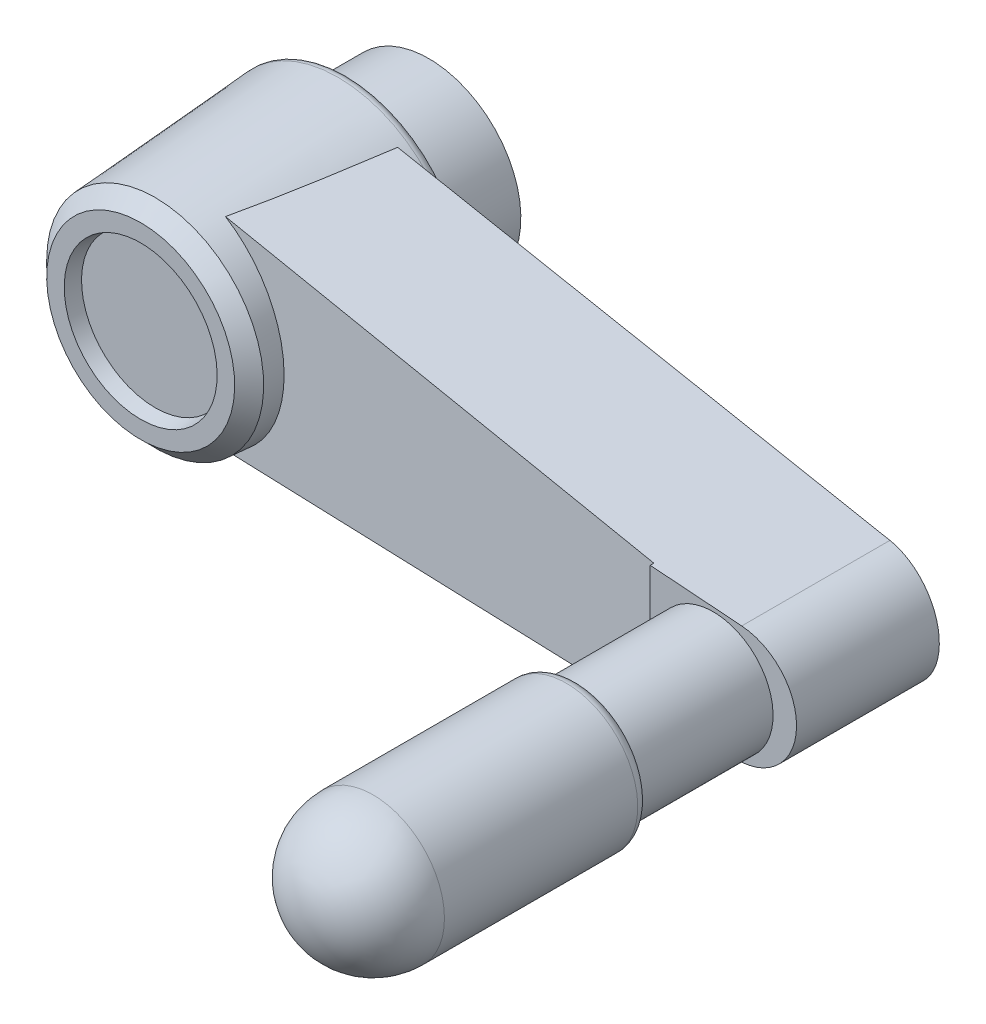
ISO-10303-21;
HEADER;
FILE_DESCRIPTION(('STEP AP214'),'2;1');
FILE_NAME('part.step','',(''),(''),'','','');
FILE_SCHEMA(('AUTOMOTIVE_DESIGN { 1 0 10303 214 1 1 1 1 }'));
ENDSEC;
DATA;
#1=APPLICATION_CONTEXT('core data for automotive mechanical design processes');
#2=APPLICATION_PROTOCOL_DEFINITION('international standard','automotive_design',2000,#1);
#3=PRODUCT_CONTEXT('',#1,'mechanical');
#4=PRODUCT('Part','Part','',(#3));
#5=PRODUCT_RELATED_PRODUCT_CATEGORY('part','',(#4));
#6=PRODUCT_DEFINITION_FORMATION('','',#4);
#7=PRODUCT_DEFINITION_CONTEXT('part definition',#1,'design');
#8=PRODUCT_DEFINITION('design','',#6,#7);
#9=PRODUCT_DEFINITION_SHAPE('','',#8);
#10=(LENGTH_UNIT() NAMED_UNIT(*) SI_UNIT(.MILLI.,.METRE.));
#11=(NAMED_UNIT(*) PLANE_ANGLE_UNIT() SI_UNIT($,.RADIAN.));
#12=(NAMED_UNIT(*) SI_UNIT($,.STERADIAN.) SOLID_ANGLE_UNIT());
#13=UNCERTAINTY_MEASURE_WITH_UNIT(LENGTH_MEASURE(1.E-05),#10,'distance_accuracy_value','');
#14=(GEOMETRIC_REPRESENTATION_CONTEXT(3) GLOBAL_UNCERTAINTY_ASSIGNED_CONTEXT((#13)) GLOBAL_UNIT_ASSIGNED_CONTEXT((#10,
#11,#12)) REPRESENTATION_CONTEXT('',''));
#15=CARTESIAN_POINT('',(0.,0.,0.));
#16=DIRECTION('',(0.,0.,1.));
#17=DIRECTION('',(1.,0.,0.));
#18=AXIS2_PLACEMENT_3D('',#15,#16,#17);
#19=CARTESIAN_POINT('',(56.85,-22.5,33.));
#20=DIRECTION('',(0.,0.,-1.));
#21=DIRECTION('',(0.,1.,0.));
#22=AXIS2_PLACEMENT_3D('',#19,#20,#21);
#23=PLANE('',#22);
#24=CARTESIAN_POINT('',(64.,0.,33.));
#25=DIRECTION('',(0.,0.,1.));
#26=DIRECTION('',(0.,-1.,0.));
#27=AXIS2_PLACEMENT_3D('',#24,#25,#26);
#28=CIRCLE('',#27,4.875);
#29=CARTESIAN_POINT('',(64.,-4.875,33.));
#30=VERTEX_POINT('',#29);
#31=EDGE_CURVE('E369',#30,#30,#28,.T.);
#32=ORIENTED_EDGE('',*,*,#31,.F.);
#33=EDGE_LOOP('',(#32));
#34=FACE_BOUND('',#33,.T.);
#35=CARTESIAN_POINT('',(66.3214285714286,0.,33.));
#36=DIRECTION('',(0.,0.,1.));
#37=DIRECTION('',(0.,-1.,0.));
#38=AXIS2_PLACEMENT_3D('',#35,#36,#37);
#39=CIRCLE('',#38,6.42857142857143);
#40=CARTESIAN_POINT('',(66.7938126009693,6.41119208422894,33.));
#41=VERTEX_POINT('',#40);
#42=CARTESIAN_POINT('',(66.7938126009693,-6.41119208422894,33.));
#43=VERTEX_POINT('',#42);
#44=EDGE_CURVE('E165',#41,#43,#39,.F.);
#45=ORIENTED_EDGE('',*,*,#44,.F.);
#46=DIRECTION('',(-0.997296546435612,0.0734819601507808,0.));
#47=VECTOR('',#46,1.);
#48=CARTESIAN_POINT('',(66.7938126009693,6.41119208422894,33.));
#49=LINE('',#48,#47);
#50=CARTESIAN_POINT('',(56.85,7.14386366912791,33.));
#51=VERTEX_POINT('',#50);
#52=EDGE_CURVE('E163',#51,#41,#49,.F.);
#53=ORIENTED_EDGE('',*,*,#52,.F.);
#54=DIRECTION('',(0.,1.,0.));
#55=VECTOR('',#54,1.);
#56=CARTESIAN_POINT('',(56.85,-22.5,33.));
#57=LINE('',#56,#55);
#58=CARTESIAN_POINT('',(56.85,-7.14386366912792,33.));
#59=VERTEX_POINT('',#58);
#60=EDGE_CURVE('E174',#59,#51,#57,.T.);
#61=ORIENTED_EDGE('',*,*,#60,.F.);
#62=DIRECTION('',(-0.997296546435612,-0.0734819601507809,0.));
#63=VECTOR('',#62,1.);
#64=CARTESIAN_POINT('',(66.7938126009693,-6.41119208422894,33.));
#65=LINE('',#64,#63);
#66=EDGE_CURVE('E171',#43,#59,#65,.T.);
#67=ORIENTED_EDGE('',*,*,#66,.F.);
#68=EDGE_LOOP('',(#45,#53,#61,#67));
#69=FACE_BOUND('',#68,.T.);
#70=ADVANCED_FACE('F15',(#34,#69),#23,.F.);
#71=CARTESIAN_POINT('',(66.3214285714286,0.,54.));
#72=DIRECTION('',(0.,0.,1.));
#73=DIRECTION('',(0.,-1.,0.));
#74=AXIS2_PLACEMENT_3D('',#71,#72,#73);
#75=CYLINDRICAL_SURFACE('',#74,6.42857142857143);
#76=CARTESIAN_POINT('',(66.3214285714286,0.,16.8547342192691));
#77=DIRECTION('',(-0.098357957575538,0.,0.995151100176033));
#78=DIRECTION('',(0.995151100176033,0.,0.098357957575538));
#79=AXIS2_PLACEMENT_3D('',#76,#77,#78);
#80=ELLIPSE('',#79,6.4598948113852,6.42857142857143);
#81=CARTESIAN_POINT('',(66.7938126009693,-6.41119208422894,16.9014233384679));
#82=VERTEX_POINT('',#81);
#83=CARTESIAN_POINT('',(66.7938126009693,6.41119208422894,16.9014233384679));
#84=VERTEX_POINT('',#83);
#85=EDGE_CURVE('E144',#82,#84,#80,.T.);
#86=ORIENTED_EDGE('',*,*,#85,.T.);
#87=DIRECTION('',(0.,0.,1.));
#88=VECTOR('',#87,1.);
#89=CARTESIAN_POINT('',(66.7938126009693,6.41119208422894,54.));
#90=LINE('',#89,#88);
#91=EDGE_CURVE('E159',#41,#84,#90,.F.);
#92=ORIENTED_EDGE('',*,*,#91,.F.);
#93=ORIENTED_EDGE('',*,*,#44,.T.);
#94=DIRECTION('',(0.,0.,1.));
#95=VECTOR('',#94,1.);
#96=CARTESIAN_POINT('',(66.7938126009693,-6.41119208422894,54.));
#97=LINE('',#96,#95);
#98=EDGE_CURVE('E153',#43,#82,#97,.F.);
#99=ORIENTED_EDGE('',*,*,#98,.T.);
#100=EDGE_LOOP('',(#86,#92,#93,#99));
#101=FACE_BOUND('',#100,.T.);
#102=ADVANCED_FACE('F399',(#101),#75,.T.);
#103=CARTESIAN_POINT('',(66.7938126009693,6.41119208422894,54.));
#104=DIRECTION('',(0.0734819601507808,0.997296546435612,0.));
#105=DIRECTION('',(-0.997296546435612,0.0734819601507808,0.));
#106=AXIS2_PLACEMENT_3D('',#103,#104,#105);
#107=PLANE('',#106);
#108=ORIENTED_EDGE('',*,*,#91,.T.);
#109=DIRECTION('',(-0.992486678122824,0.0731275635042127,-0.0980946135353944));
#110=VECTOR('',#109,1.);
#111=CARTESIAN_POINT('',(66.7938126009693,6.41119208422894,16.9014233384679));
#112=LINE('',#111,#110);
#113=CARTESIAN_POINT('',(7.45140024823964,10.7836094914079,11.0361849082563));
#114=VERTEX_POINT('',#113);
#115=EDGE_CURVE('E162',#84,#114,#112,.T.);
#116=ORIENTED_EDGE('',*,*,#115,.T.);
#117=CARTESIAN_POINT('',(7.45140024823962,10.7836094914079,11.0361849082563));
#118=CARTESIAN_POINT('',(7.35884986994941,10.7904287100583,11.7083102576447));
#119=CARTESIAN_POINT('',(7.2649001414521,10.7973510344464,12.380240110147));
#120=CARTESIAN_POINT('',(7.07377479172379,10.8114333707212,13.7236404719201));
#121=CARTESIAN_POINT('',(6.97659915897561,10.8185933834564,14.3951109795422));
#122=CARTESIAN_POINT('',(6.679647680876,10.8404731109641,16.4083572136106));
#123=CARTESIAN_POINT('',(6.47439717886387,10.8555962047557,17.7493347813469));
#124=CARTESIAN_POINT('',(6.15147821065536,10.8793892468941,19.7584309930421));
#125=CARTESIAN_POINT('',(6.04132594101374,10.8875053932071,20.427765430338));
#126=CARTESIAN_POINT('',(5.81495956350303,10.9041843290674,21.7653928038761));
#127=CARTESIAN_POINT('',(5.69874557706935,10.9127471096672,22.4336857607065));
#128=CARTESIAN_POINT('',(5.45886515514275,10.9304217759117,23.7691170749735));
#129=CARTESIAN_POINT('',(5.33519675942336,10.939533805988,24.4362550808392));
#130=CARTESIAN_POINT('',(5.14263983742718,10.9537216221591,25.4356189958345));
#131=CARTESIAN_POINT('',(5.07727608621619,10.9585376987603,25.7685279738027));
#132=CARTESIAN_POINT('',(4.94384165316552,10.9683693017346,26.4338053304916));
#133=CARTESIAN_POINT('',(4.87577092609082,10.9733848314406,26.7661737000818));
#134=CARTESIAN_POINT('',(4.80616947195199,10.9785131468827,27.0982236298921));
#135=B_SPLINE_CURVE_WITH_KNOTS('',3,(#117,#118,#119,#120,#121,#122,#123,#124,#125,#126,#127,
#128,#129,#130,#131,#132,#133,#134),.UNSPECIFIED.,.F.,.F.,(4,2,2,2,2,2,2,2,4),(0.,
2.03549899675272,4.07100526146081,8.14090618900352,10.1760438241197,12.2111407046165,
14.2467750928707,15.2646628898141,16.2825677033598),.UNSPECIFIED.);
#136=CARTESIAN_POINT('',(4.80616947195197,10.9785131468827,27.0982236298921));
#137=VERTEX_POINT('',#136);
#138=EDGE_CURVE('E140',#114,#137,#135,.T.);
#139=ORIENTED_EDGE('',*,*,#138,.T.);
#140=DIRECTION('',(0.991799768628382,-0.0730769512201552,0.104847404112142));
#141=VECTOR('',#140,1.);
#142=CARTESIAN_POINT('',(4.80616947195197,10.9785131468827,27.0982236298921));
#143=LINE('',#142,#141);
#144=CARTESIAN_POINT('',(56.85,7.14386366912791,32.6));
#145=VERTEX_POINT('',#144);
#146=EDGE_CURVE('E168',#137,#145,#143,.T.);
#147=ORIENTED_EDGE('',*,*,#146,.T.);
#148=DIRECTION('',(-1.42108547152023E-13,0.,1.));
#149=VECTOR('',#148,1.);
#150=CARTESIAN_POINT('',(56.85,7.14386366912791,32.6));
#151=LINE('',#150,#149);
#152=EDGE_CURVE('E194',#145,#51,#151,.T.);
#153=ORIENTED_EDGE('',*,*,#152,.T.);
#154=ORIENTED_EDGE('',*,*,#52,.T.);
#155=EDGE_LOOP('',(#108,#116,#139,#147,#153,#154));
#156=FACE_BOUND('',#155,.T.);
#157=ADVANCED_FACE('F393',(#156),#107,.T.);
#158=CARTESIAN_POINT('',(56.85,-22.5,32.6));
#159=DIRECTION('',(1.,0.,1.42108547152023E-13));
#160=DIRECTION('',(-1.42108547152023E-13,0.,1.));
#161=AXIS2_PLACEMENT_3D('',#158,#159,#160);
#162=PLANE('',#161);
#163=ORIENTED_EDGE('',*,*,#60,.T.);
#164=ORIENTED_EDGE('',*,*,#152,.F.);
#165=DIRECTION('',(0.,-1.,0.));
#166=VECTOR('',#165,1.);
#167=CARTESIAN_POINT('',(56.85,-22.5,32.6));
#168=LINE('',#167,#166);
#169=CARTESIAN_POINT('',(56.85,-7.14386366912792,32.6));
#170=VERTEX_POINT('',#169);
#171=EDGE_CURVE('E183',#145,#170,#168,.T.);
#172=ORIENTED_EDGE('',*,*,#171,.T.);
#173=DIRECTION('',(0.,0.,1.));
#174=VECTOR('',#173,1.);
#175=CARTESIAN_POINT('',(56.85,-7.14386366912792,54.));
#176=LINE('',#175,#174);
#177=EDGE_CURVE('E133',#59,#170,#176,.F.);
#178=ORIENTED_EDGE('',*,*,#177,.F.);
#179=EDGE_LOOP('',(#163,#164,#172,#178));
#180=FACE_BOUND('',#179,.T.);
#181=ADVANCED_FACE('F398',(#180),#162,.F.);
#182=CARTESIAN_POINT('',(0.830493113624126,-11.2714455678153,54.));
#183=DIRECTION('',(0.0734819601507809,-0.997296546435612,0.));
#184=DIRECTION('',(0.997296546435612,0.0734819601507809,0.));
#185=AXIS2_PLACEMENT_3D('',#182,#183,#184);
#186=PLANE('',#185);
#187=ORIENTED_EDGE('',*,*,#177,.T.);
#188=DIRECTION('',(-0.991799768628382,-0.0730769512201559,-0.104847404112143));
#189=VECTOR('',#188,1.);
#190=CARTESIAN_POINT('',(56.85,-7.14386366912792,32.6));
#191=LINE('',#190,#189);
#192=CARTESIAN_POINT('',(4.80616948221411,-10.9785131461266,27.0982235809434));
#193=VERTEX_POINT('',#192);
#194=EDGE_CURVE('E130',#170,#193,#191,.T.);
#195=ORIENTED_EDGE('',*,*,#194,.T.);
#196=CARTESIAN_POINT('',(7.45140024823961,-10.7836094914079,11.0361849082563));
#197=CARTESIAN_POINT('',(7.35884987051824,-10.7904287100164,11.7083102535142));
#198=CARTESIAN_POINT('',(7.26490014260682,-10.7973510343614,12.3802401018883));
#199=CARTESIAN_POINT('',(7.07377479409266,-10.8114333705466,13.7236404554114));
#200=CARTESIAN_POINT('',(6.97659916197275,-10.8185933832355,14.3951109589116));
#201=CARTESIAN_POINT('',(6.67964768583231,-10.8404731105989,16.4083571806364));
#202=CARTESIAN_POINT('',(6.47439718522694,-10.8555962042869,17.7493347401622));
#203=CARTESIAN_POINT('',(6.15147821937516,-10.8793892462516,19.758430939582));
#204=CARTESIAN_POINT('',(6.04132595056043,-10.8875053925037,20.4277653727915));
#205=CARTESIAN_POINT('',(5.8149595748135,-10.9041843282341,21.7653927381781));
#206=CARTESIAN_POINT('',(5.69874558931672,-10.9127471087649,22.4336856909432));
#207=CARTESIAN_POINT('',(5.45886516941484,-10.9304217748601,23.7691169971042));
#208=CARTESIAN_POINT('',(5.33519677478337,-10.9395338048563,24.4362549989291));
#209=CARTESIAN_POINT('',(5.14263985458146,-10.9537216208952,25.4356189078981));
#210=CARTESIAN_POINT('',(5.07727610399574,-10.9585376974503,25.7685278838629));
#211=CARTESIAN_POINT('',(4.94384167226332,-10.9683693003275,26.4338052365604));
#212=CARTESIAN_POINT('',(4.87577094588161,-10.9733848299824,26.7661736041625));
#213=CARTESIAN_POINT('',(4.80616949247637,-10.9785131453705,27.0982235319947));
#214=B_SPLINE_CURVE_WITH_KNOTS('',3,(#196,#197,#198,#199,#200,#201,#202,#203,#204,#205,#206,
#207,#208,#209,#210,#211,#212,#213),.UNSPECIFIED.,.F.,.F.,(4,2,2,2,2,2,2,2,4),(0.,
2.03549898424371,4.07100523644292,8.14090613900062,10.1760437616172,12.2111406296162,
14.2467750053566,15.2646627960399,16.2825676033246),.UNSPECIFIED.);
#215=CARTESIAN_POINT('',(7.45140024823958,-10.7836094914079,11.0361849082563));
#216=VERTEX_POINT('',#215);
#217=EDGE_CURVE('E121',#216,#193,#214,.T.);
#218=ORIENTED_EDGE('',*,*,#217,.F.);
#219=DIRECTION('',(0.992486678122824,0.0731275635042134,0.0980946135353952));
#220=VECTOR('',#219,1.);
#221=CARTESIAN_POINT('',(7.45140024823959,-10.7836094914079,11.0361849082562));
#222=LINE('',#221,#220);
#223=EDGE_CURVE('E127',#216,#82,#222,.T.);
#224=ORIENTED_EDGE('',*,*,#223,.T.);
#225=ORIENTED_EDGE('',*,*,#98,.F.);
#226=ORIENTED_EDGE('',*,*,#66,.T.);
#227=EDGE_LOOP('',(#187,#195,#218,#224,#225,#226));
#228=FACE_BOUND('',#227,.T.);
#229=ADVANCED_FACE('F124',(#228),#186,.T.);
#230=CARTESIAN_POINT('',(64.,0.,23.97925));
#231=DIRECTION('',(0.,0.,-1.));
#232=DIRECTION('',(0.,1.,0.));
#233=AXIS2_PLACEMENT_3D('',#230,#231,#232);
#234=CYLINDRICAL_SURFACE('',#233,2.4585);
#235=CARTESIAN_POINT('',(64.,0.,16.6252906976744));
#236=DIRECTION('',(-0.098357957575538,0.,0.995151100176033));
#237=DIRECTION('',(-0.995151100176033,0.,-0.098357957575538));
#238=AXIS2_PLACEMENT_3D('',#235,#236,#237);
#239=ELLIPSE('',#238,2.47047910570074,2.4585);
#240=CARTESIAN_POINT('',(61.5415,0.,16.3822994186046));
#241=VERTEX_POINT('',#240);
#242=EDGE_CURVE('E149',#241,#241,#239,.F.);
#243=ORIENTED_EDGE('',*,*,#242,.T.);
#244=EDGE_LOOP('',(#243));
#245=FACE_BOUND('',#244,.T.);
#246=CARTESIAN_POINT('',(64.,0.,20.0719999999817));
#247=DIRECTION('',(0.,0.,1.));
#248=DIRECTION('',(0.,-1.,0.));
#249=AXIS2_PLACEMENT_3D('',#246,#247,#248);
#250=CIRCLE('',#249,2.4585);
#251=CARTESIAN_POINT('',(64.,-2.4585,20.0719999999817));
#252=VERTEX_POINT('',#251);
#253=EDGE_CURVE('E9',#252,#252,#250,.F.);
#254=ORIENTED_EDGE('',*,*,#253,.F.);
#255=EDGE_LOOP('',(#254));
#256=FACE_BOUND('',#255,.T.);
#257=ADVANCED_FACE('F405',(#245,#256),#234,.F.);
#258=CARTESIAN_POINT('',(72.85,-22.5,17.5));
#259=DIRECTION('',(-0.098357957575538,0.,0.995151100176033));
#260=DIRECTION('',(-0.995151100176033,0.,-0.098357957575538));
#261=AXIS2_PLACEMENT_3D('',#258,#259,#260);
#262=PLANE('',#261);
#263=CARTESIAN_POINT('',(-0.0909518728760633,0.,10.2907198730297));
#264=DIRECTION('',(-0.098357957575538,0.,0.995151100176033));
#265=DIRECTION('',(-0.995151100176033,0.,-0.098357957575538));
#266=AXIS2_PLACEMENT_3D('',#263,#264,#265);
#267=ELLIPSE('',#266,13.2238652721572,13.1594297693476);
#268=EDGE_CURVE('E136',#114,#216,#267,.F.);
#269=ORIENTED_EDGE('',*,*,#268,.F.);
#270=ORIENTED_EDGE('',*,*,#115,.F.);
#271=ORIENTED_EDGE('',*,*,#85,.F.);
#272=ORIENTED_EDGE('',*,*,#223,.F.);
#273=EDGE_LOOP('',(#269,#270,#271,#272));
#274=FACE_BOUND('',#273,.T.);
#275=ORIENTED_EDGE('',*,*,#242,.F.);
#276=EDGE_LOOP('',(#275));
#277=FACE_BOUND('',#276,.T.);
#278=ADVANCED_FACE('F147',(#274,#277),#262,.F.);
#279=CARTESIAN_POINT('',(-13.15,-22.5,25.2));
#280=DIRECTION('',(0.105128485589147,0.,-0.994458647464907));
#281=DIRECTION('',(0.994458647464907,0.,0.105128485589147));
#282=AXIS2_PLACEMENT_3D('',#279,#280,#281);
#283=PLANE('',#282);
#284=CARTESIAN_POINT('',(-0.0888596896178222,0.,26.5807491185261));
#285=DIRECTION('',(0.105128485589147,0.,-0.994458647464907));
#286=DIRECTION('',(-0.994458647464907,0.,-0.105128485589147));
#287=AXIS2_PLACEMENT_3D('',#284,#285,#286);
#288=ELLIPSE('',#287,12.0876160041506,12.0203058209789);
#289=EDGE_CURVE('E179',#193,#137,#288,.F.);
#290=ORIENTED_EDGE('',*,*,#289,.F.);
#291=ORIENTED_EDGE('',*,*,#194,.F.);
#292=ORIENTED_EDGE('',*,*,#171,.F.);
#293=ORIENTED_EDGE('',*,*,#146,.F.);
#294=EDGE_LOOP('',(#290,#291,#292,#293));
#295=FACE_BOUND('',#294,.T.);
#296=ADVANCED_FACE('F404',(#295),#283,.F.);
#297=CARTESIAN_POINT('',(0.,0.,10.0697564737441));
#298=DIRECTION('',(0.,0.,-1.));
#299=DIRECTION('',(0.,1.,0.));
#300=AXIS2_PLACEMENT_3D('',#297,#298,#299);
#301=CONICAL_SURFACE('',#300,13.1751953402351,0.0698131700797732);
#302=CARTESIAN_POINT('',(0.,0.,29.925));
#303=DIRECTION('',(0.,0.,-1.));
#304=DIRECTION('',(-1.,0.,0.));
#305=AXIS2_PLACEMENT_3D('',#302,#303,#304);
#306=CIRCLE('',#305,11.786781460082);
#307=CARTESIAN_POINT('',(-11.786781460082,0.,29.925));
#308=VERTEX_POINT('',#307);
#309=EDGE_CURVE('E132',#308,#308,#306,.T.);
#310=ORIENTED_EDGE('',*,*,#309,.T.);
#311=EDGE_LOOP('',(#310));
#312=FACE_BOUND('',#311,.T.);
#313=ORIENTED_EDGE('',*,*,#217,.T.);
#314=ORIENTED_EDGE('',*,*,#289,.T.);
#315=ORIENTED_EDGE('',*,*,#138,.F.);
#316=ORIENTED_EDGE('',*,*,#268,.T.);
#317=EDGE_LOOP('',(#313,#314,#315,#316));
#318=FACE_BOUND('',#317,.T.);
#319=CARTESIAN_POINT('',(0.,0.,10.0697564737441));
#320=DIRECTION('',(0.,0.,-1.));
#321=DIRECTION('',(-1.,0.,0.));
#322=AXIS2_PLACEMENT_3D('',#319,#320,#321);
#323=CIRCLE('',#322,13.1751953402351);
#324=CARTESIAN_POINT('',(-13.1751953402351,0.,10.0697564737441));
#325=VERTEX_POINT('',#324);
#326=EDGE_CURVE('E187',#325,#325,#323,.F.);
#327=ORIENTED_EDGE('',*,*,#326,.T.);
#328=EDGE_LOOP('',(#327));
#329=FACE_BOUND('',#328,.T.);
#330=ADVANCED_FACE('F137',(#312,#318,#329),#301,.T.);
#331=CARTESIAN_POINT('',(0.,0.,29.925));
#332=DIRECTION('',(0.,0.,-1.));
#333=DIRECTION('',(0.,1.,0.));
#334=AXIS2_PLACEMENT_3D('',#331,#332,#333);
#335=CONICAL_SURFACE('',#334,11.786781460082,0.785398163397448);
#336=CARTESIAN_POINT('',(0.,0.,31.5));
#337=DIRECTION('',(0.,0.,-1.));
#338=DIRECTION('',(0.,1.,0.));
#339=AXIS2_PLACEMENT_3D('',#336,#337,#338);
#340=CIRCLE('',#339,10.211781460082);
#341=CARTESIAN_POINT('',(0.,10.211781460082,31.5));
#342=VERTEX_POINT('',#341);
#343=EDGE_CURVE('E196',#342,#342,#340,.T.);
#344=ORIENTED_EDGE('',*,*,#343,.T.);
#345=EDGE_LOOP('',(#344));
#346=FACE_BOUND('',#345,.T.);
#347=ORIENTED_EDGE('',*,*,#309,.F.);
#348=EDGE_LOOP('',(#347));
#349=FACE_BOUND('',#348,.T.);
#350=ADVANCED_FACE('F215',(#346,#349),#335,.T.);
#351=CARTESIAN_POINT('',(0.,0.,10.));
#352=DIRECTION('',(0.,0.,-1.));
#353=DIRECTION('',(0.,1.,0.));
#354=AXIS2_PLACEMENT_3D('',#351,#352,#353);
#355=TOROIDAL_SURFACE('',#354,12.1776312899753,1.);
#356=CARTESIAN_POINT('',(0.,0.,9.));
#357=DIRECTION('',(0.,0.,1.));
#358=DIRECTION('',(0.,-1.,0.));
#359=AXIS2_PLACEMENT_3D('',#356,#357,#358);
#360=CIRCLE('',#359,12.1776312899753);
#361=CARTESIAN_POINT('',(0.,-12.1776312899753,9.));
#362=VERTEX_POINT('',#361);
#363=CARTESIAN_POINT('',(0.,12.1776312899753,9.));
#364=VERTEX_POINT('',#363);
#365=EDGE_CURVE('E241',#362,#364,#360,.T.);
#366=ORIENTED_EDGE('',*,*,#365,.T.);
#367=CARTESIAN_POINT('',(0.,0.,9.));
#368=DIRECTION('',(0.,0.,1.));
#369=DIRECTION('',(0.,1.,0.));
#370=AXIS2_PLACEMENT_3D('',#367,#368,#369);
#371=CIRCLE('',#370,12.1776312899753);
#372=CARTESIAN_POINT('',(-12.1776312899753,0.,9.));
#373=VERTEX_POINT('',#372);
#374=EDGE_CURVE('E238',#364,#373,#371,.T.);
#375=ORIENTED_EDGE('',*,*,#374,.T.);
#376=CARTESIAN_POINT('',(0.,0.,9.));
#377=DIRECTION('',(0.,0.,1.));
#378=DIRECTION('',(-1.,0.,0.));
#379=AXIS2_PLACEMENT_3D('',#376,#377,#378);
#380=CIRCLE('',#379,12.1776312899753);
#381=EDGE_CURVE('E240',#373,#362,#380,.T.);
#382=ORIENTED_EDGE('',*,*,#381,.T.);
#383=EDGE_LOOP('',(#366,#375,#382));
#384=FACE_BOUND('',#383,.T.);
#385=ORIENTED_EDGE('',*,*,#326,.F.);
#386=EDGE_LOOP('',(#385));
#387=FACE_BOUND('',#386,.T.);
#388=ADVANCED_FACE('F209',(#384,#387),#355,.T.);
#389=CARTESIAN_POINT('',(-9.25896522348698,0.,31.5));
#390=DIRECTION('',(0.,0.,1.));
#391=DIRECTION('',(0.,-1.,0.));
#392=AXIS2_PLACEMENT_3D('',#389,#390,#391);
#393=PLANE('',#392);
#394=CARTESIAN_POINT('',(0.,0.,31.5));
#395=DIRECTION('',(0.,0.,1.));
#396=DIRECTION('',(0.,-1.,0.));
#397=AXIS2_PLACEMENT_3D('',#394,#395,#396);
#398=CIRCLE('',#397,8.3061489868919);
#399=CARTESIAN_POINT('',(0.,-8.3061489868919,31.5));
#400=VERTEX_POINT('',#399);
#401=EDGE_CURVE('E243',#400,#400,#398,.F.);
#402=ORIENTED_EDGE('',*,*,#401,.T.);
#403=EDGE_LOOP('',(#402));
#404=FACE_BOUND('',#403,.T.);
#405=ORIENTED_EDGE('',*,*,#343,.F.);
#406=EDGE_LOOP('',(#405));
#407=FACE_BOUND('',#406,.T.);
#408=ADVANCED_FACE('F214',(#404,#407),#393,.T.);
#409=CARTESIAN_POINT('',(-11.0888156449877,0.,9.));
#410=DIRECTION('',(0.,0.,-1.));
#411=DIRECTION('',(1.,0.,0.));
#412=AXIS2_PLACEMENT_3D('',#409,#410,#411);
#413=PLANE('',#412);
#414=ORIENTED_EDGE('',*,*,#365,.F.);
#415=ORIENTED_EDGE('',*,*,#381,.F.);
#416=ORIENTED_EDGE('',*,*,#374,.F.);
#417=EDGE_LOOP('',(#414,#415,#416));
#418=FACE_BOUND('',#417,.T.);
#419=CARTESIAN_POINT('',(0.,0.,9.));
#420=DIRECTION('',(0.,0.,1.));
#421=DIRECTION('',(0.,-1.,0.));
#422=AXIS2_PLACEMENT_3D('',#419,#420,#421);
#423=CIRCLE('',#422,10.);
#424=CARTESIAN_POINT('',(0.,-10.,9.));
#425=VERTEX_POINT('',#424);
#426=EDGE_CURVE('E245',#425,#425,#423,.T.);
#427=ORIENTED_EDGE('',*,*,#426,.T.);
#428=EDGE_LOOP('',(#427));
#429=FACE_BOUND('',#428,.T.);
#430=ADVANCED_FACE('F661',(#418,#429),#413,.T.);
#431=CARTESIAN_POINT('',(0.,0.,31.5));
#432=DIRECTION('',(0.,0.,1.));
#433=DIRECTION('',(0.,-1.,0.));
#434=AXIS2_PLACEMENT_3D('',#431,#432,#433);
#435=CONICAL_SURFACE('',#434,8.3061489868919,0.191986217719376);
#436=ORIENTED_EDGE('',*,*,#401,.F.);
#437=EDGE_LOOP('',(#436));
#438=FACE_BOUND('',#437,.T.);
#439=CARTESIAN_POINT('',(0.,0.,29.925));
#440=DIRECTION('',(0.,0.,1.));
#441=DIRECTION('',(0.,-1.,0.));
#442=AXIS2_PLACEMENT_3D('',#439,#440,#441);
#443=CIRCLE('',#442,8.);
#444=CARTESIAN_POINT('',(0.,-8.,29.925));
#445=VERTEX_POINT('',#444);
#446=EDGE_CURVE('E250',#445,#445,#443,.T.);
#447=ORIENTED_EDGE('',*,*,#446,.F.);
#448=EDGE_LOOP('',(#447));
#449=FACE_BOUND('',#448,.T.);
#450=ADVANCED_FACE('F669',(#438,#449),#435,.F.);
#451=CARTESIAN_POINT('',(0.,0.,4.6));
#452=DIRECTION('',(0.,0.,1.));
#453=DIRECTION('',(0.,-1.,0.));
#454=AXIS2_PLACEMENT_3D('',#451,#452,#453);
#455=CYLINDRICAL_SURFACE('',#454,10.);
#456=CARTESIAN_POINT('',(0.,0.,0.2));
#457=DIRECTION('',(0.,0.,1.));
#458=DIRECTION('',(0.,-1.,0.));
#459=AXIS2_PLACEMENT_3D('',#456,#457,#458);
#460=CIRCLE('',#459,10.);
#461=CARTESIAN_POINT('',(0.,-10.,0.2));
#462=VERTEX_POINT('',#461);
#463=EDGE_CURVE('E256',#462,#462,#460,.T.);
#464=ORIENTED_EDGE('',*,*,#463,.T.);
#465=EDGE_LOOP('',(#464));
#466=FACE_BOUND('',#465,.T.);
#467=ORIENTED_EDGE('',*,*,#426,.F.);
#468=EDGE_LOOP('',(#467));
#469=FACE_BOUND('',#468,.T.);
#470=ADVANCED_FACE('F677',(#466,#469),#455,.T.);
#471=CARTESIAN_POINT('',(-4.,0.,29.925));
#472=DIRECTION('',(0.,0.,1.));
#473=DIRECTION('',(-1.,0.,0.));
#474=AXIS2_PLACEMENT_3D('',#471,#472,#473);
#475=PLANE('',#474);
#476=ORIENTED_EDGE('',*,*,#446,.T.);
#477=EDGE_LOOP('',(#476));
#478=FACE_BOUND('',#477,.T.);
#479=ADVANCED_FACE('F687',(#478),#475,.T.);
#480=CARTESIAN_POINT('',(-8.75,0.,0.2));
#481=DIRECTION('',(0.,0.,-1.));
#482=DIRECTION('',(1.,0.,0.));
#483=AXIS2_PLACEMENT_3D('',#480,#481,#482);
#484=PLANE('',#483);
#485=ORIENTED_EDGE('',*,*,#463,.F.);
#486=EDGE_LOOP('',(#485));
#487=FACE_BOUND('',#486,.T.);
#488=CARTESIAN_POINT('',(0.,0.,0.2));
#489=DIRECTION('',(0.,0.,1.));
#490=DIRECTION('',(0.,-1.,0.));
#491=AXIS2_PLACEMENT_3D('',#488,#489,#490);
#492=CIRCLE('',#491,7.5);
#493=CARTESIAN_POINT('',(0.,-7.5,0.2));
#494=VERTEX_POINT('',#493);
#495=EDGE_CURVE('E259',#494,#494,#492,.T.);
#496=ORIENTED_EDGE('',*,*,#495,.T.);
#497=EDGE_LOOP('',(#496));
#498=FACE_BOUND('',#497,.T.);
#499=ADVANCED_FACE('F697',(#487,#498),#484,.T.);
#500=CARTESIAN_POINT('',(0.,0.,0.1));
#501=DIRECTION('',(0.,0.,1.));
#502=DIRECTION('',(0.,-1.,0.));
#503=AXIS2_PLACEMENT_3D('',#500,#501,#502);
#504=CYLINDRICAL_SURFACE('',#503,7.5);
#505=CARTESIAN_POINT('',(0.,0.,0.));
#506=DIRECTION('',(0.,0.,1.));
#507=DIRECTION('',(0.,-1.,0.));
#508=AXIS2_PLACEMENT_3D('',#505,#506,#507);
#509=CIRCLE('',#508,7.5);
#510=CARTESIAN_POINT('',(0.,-7.5,0.));
#511=VERTEX_POINT('',#510);
#512=EDGE_CURVE('E262',#511,#511,#509,.T.);
#513=ORIENTED_EDGE('',*,*,#512,.T.);
#514=EDGE_LOOP('',(#513));
#515=FACE_BOUND('',#514,.T.);
#516=ORIENTED_EDGE('',*,*,#495,.F.);
#517=EDGE_LOOP('',(#516));
#518=FACE_BOUND('',#517,.T.);
#519=ADVANCED_FACE('F707',(#515,#518),#504,.T.);
#520=CARTESIAN_POINT('',(-3.75,0.,0.));
#521=DIRECTION('',(0.,0.,-1.));
#522=DIRECTION('',(0.,1.,0.));
#523=AXIS2_PLACEMENT_3D('',#520,#521,#522);
#524=PLANE('',#523);
#525=ORIENTED_EDGE('',*,*,#512,.F.);
#526=EDGE_LOOP('',(#525));
#527=FACE_BOUND('',#526,.T.);
#528=CARTESIAN_POINT('',(0.,0.,5.6843418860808E-11));
#529=DIRECTION('',(0.,0.,-1.));
#530=DIRECTION('',(0.,1.,0.));
#531=AXIS2_PLACEMENT_3D('',#528,#529,#530);
#532=CIRCLE('',#531,4.66249999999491);
#533=CARTESIAN_POINT('',(0.,4.66249999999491,5.6843418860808E-11));
#534=VERTEX_POINT('',#533);
#535=EDGE_CURVE('E265',#534,#534,#532,.F.);
#536=ORIENTED_EDGE('',*,*,#535,.T.);
#537=EDGE_LOOP('',(#536));
#538=FACE_BOUND('',#537,.T.);
#539=ADVANCED_FACE('F717',(#527,#538),#524,.T.);
#540=CARTESIAN_POINT('',(0.,0.,5.6843418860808E-11));
#541=DIRECTION('',(0.,0.,-1.));
#542=DIRECTION('',(0.,1.,0.));
#543=AXIS2_PLACEMENT_3D('',#540,#541,#542);
#544=CONICAL_SURFACE('',#543,4.66249999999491,0.785398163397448);
#545=ORIENTED_EDGE('',*,*,#535,.F.);
#546=EDGE_LOOP('',(#545));
#547=FACE_BOUND('',#546,.T.);
#548=CARTESIAN_POINT('',(0.,0.,0.662500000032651));
#549=DIRECTION('',(0.,0.,-1.));
#550=DIRECTION('',(1.,0.,0.));
#551=AXIS2_PLACEMENT_3D('',#548,#549,#550);
#552=CIRCLE('',#551,3.99999999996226);
#553=CARTESIAN_POINT('',(3.99999999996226,0.,0.662500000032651));
#554=VERTEX_POINT('',#553);
#555=EDGE_CURVE('E267',#554,#554,#552,.T.);
#556=ORIENTED_EDGE('',*,*,#555,.F.);
#557=EDGE_LOOP('',(#556));
#558=FACE_BOUND('',#557,.T.);
#559=ADVANCED_FACE('F727',(#547,#558),#544,.F.);
#560=CARTESIAN_POINT('',(0.,0.,10.33125));
#561=DIRECTION('',(0.,0.,-1.));
#562=DIRECTION('',(0.,1.,0.));
#563=AXIS2_PLACEMENT_3D('',#560,#561,#562);
#564=CYLINDRICAL_SURFACE('',#563,4.);
#565=ORIENTED_EDGE('',*,*,#555,.T.);
#566=EDGE_LOOP('',(#565));
#567=FACE_BOUND('',#566,.T.);
#568=CARTESIAN_POINT('',(0.,0.,20.));
#569=DIRECTION('',(0.,0.,-1.));
#570=DIRECTION('',(0.,1.,0.));
#571=AXIS2_PLACEMENT_3D('',#568,#569,#570);
#572=CIRCLE('',#571,4.);
#573=CARTESIAN_POINT('',(0.,4.,20.));
#574=VERTEX_POINT('',#573);
#575=EDGE_CURVE('E389',#574,#574,#572,.T.);
#576=ORIENTED_EDGE('',*,*,#575,.F.);
#577=EDGE_LOOP('',(#576));
#578=FACE_BOUND('',#577,.T.);
#579=ADVANCED_FACE('F737',(#567,#578),#564,.F.);
#580=CARTESIAN_POINT('',(0.,0.,20.0000000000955));
#581=DIRECTION('',(0.,0.,-1.));
#582=DIRECTION('',(0.,1.,0.));
#583=AXIS2_PLACEMENT_3D('',#580,#581,#582);
#584=CONICAL_SURFACE('',#583,3.99999999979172,1.04719755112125);
#585=CARTESIAN_POINT('',(2.55795384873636E-10,0.,22.3094010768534));
#586=VERTEX_POINT('',#585);
#587=VERTEX_LOOP('',#586);
#588=FACE_BOUND('',#587,.T.);
#589=ORIENTED_EDGE('',*,*,#575,.T.);
#590=EDGE_LOOP('',(#589));
#591=FACE_BOUND('',#590,.T.);
#592=ADVANCED_FACE('F17',(#588,#591),#584,.F.);
#593=CARTESIAN_POINT('',(64.,1.19325,20.));
#594=DIRECTION('',(0.,0.,-1.));
#595=DIRECTION('',(0.,1.,0.));
#596=AXIS2_PLACEMENT_3D('',#593,#594,#595);
#597=PLANE('',#596);
#598=CARTESIAN_POINT('',(64.,0.,19.9999999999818));
#599=DIRECTION('',(0.,0.,1.));
#600=DIRECTION('',(0.,-1.,0.));
#601=AXIS2_PLACEMENT_3D('',#598,#599,#600);
#602=CIRCLE('',#601,2.38650000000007);
#603=CARTESIAN_POINT('',(64.,-2.38650000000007,19.9999999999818));
#604=VERTEX_POINT('',#603);
#605=EDGE_CURVE('E318',#604,#604,#602,.T.);
#606=ORIENTED_EDGE('',*,*,#605,.F.);
#607=EDGE_LOOP('',(#606));
#608=FACE_BOUND('',#607,.T.);
#609=DIRECTION('',(0.,1.,0.));
#610=VECTOR('',#609,1.);
#611=CARTESIAN_POINT('',(65.5,0.866025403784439,20.));
#612=LINE('',#611,#610);
#613=CARTESIAN_POINT('',(65.5,-0.866025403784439,20.));
#614=VERTEX_POINT('',#613);
#615=CARTESIAN_POINT('',(65.5,0.86602540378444,20.));
#616=VERTEX_POINT('',#615);
#617=EDGE_CURVE('E340',#614,#616,#612,.T.);
#618=ORIENTED_EDGE('',*,*,#617,.T.);
#619=DIRECTION('',(-0.866025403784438,0.5,0.));
#620=VECTOR('',#619,1.);
#621=CARTESIAN_POINT('',(65.5,0.866025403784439,20.));
#622=LINE('',#621,#620);
#623=CARTESIAN_POINT('',(64.,1.73205080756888,20.));
#624=VERTEX_POINT('',#623);
#625=EDGE_CURVE('E319',#616,#624,#622,.T.);
#626=ORIENTED_EDGE('',*,*,#625,.T.);
#627=DIRECTION('',(-0.866025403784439,-0.5,0.));
#628=VECTOR('',#627,1.);
#629=CARTESIAN_POINT('',(62.5,0.866025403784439,20.));
#630=LINE('',#629,#628);
#631=CARTESIAN_POINT('',(62.5,0.866025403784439,20.));
#632=VERTEX_POINT('',#631);
#633=EDGE_CURVE('E338',#624,#632,#630,.T.);
#634=ORIENTED_EDGE('',*,*,#633,.T.);
#635=DIRECTION('',(0.,-1.,0.));
#636=VECTOR('',#635,1.);
#637=CARTESIAN_POINT('',(62.5,-0.866025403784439,20.));
#638=LINE('',#637,#636);
#639=CARTESIAN_POINT('',(62.5,-0.86602540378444,20.));
#640=VERTEX_POINT('',#639);
#641=EDGE_CURVE('E350',#632,#640,#638,.T.);
#642=ORIENTED_EDGE('',*,*,#641,.T.);
#643=DIRECTION('',(0.866025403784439,-0.5,0.));
#644=VECTOR('',#643,1.);
#645=CARTESIAN_POINT('',(64.,-1.73205080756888,20.));
#646=LINE('',#645,#644);
#647=CARTESIAN_POINT('',(64.,-1.73205080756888,20.));
#648=VERTEX_POINT('',#647);
#649=EDGE_CURVE('E362',#640,#648,#646,.T.);
#650=ORIENTED_EDGE('',*,*,#649,.T.);
#651=DIRECTION('',(0.866025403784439,0.5,0.));
#652=VECTOR('',#651,1.);
#653=CARTESIAN_POINT('',(65.5,-0.866025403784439,20.));
#654=LINE('',#653,#652);
#655=EDGE_CURVE('E355',#648,#614,#654,.T.);
#656=ORIENTED_EDGE('',*,*,#655,.T.);
#657=EDGE_LOOP('',(#618,#626,#634,#642,#650,#656));
#658=FACE_BOUND('',#657,.T.);
#659=ADVANCED_FACE('F465',(#608,#658),#597,.T.);
#660=CARTESIAN_POINT('',(64.,1.73205080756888,20.));
#661=DIRECTION('',(0.5,0.866025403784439,0.));
#662=DIRECTION('',(-0.866025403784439,0.5,0.));
#663=AXIS2_PLACEMENT_3D('',#660,#661,#662);
#664=PLANE('',#663);
#665=DIRECTION('',(0.,0.,1.));
#666=VECTOR('',#665,1.);
#667=CARTESIAN_POINT('',(64.,1.73205080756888,20.));
#668=LINE('',#667,#666);
#669=CARTESIAN_POINT('',(64.,1.73205080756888,23.));
#670=VERTEX_POINT('',#669);
#671=EDGE_CURVE('E325',#624,#670,#668,.T.);
#672=ORIENTED_EDGE('',*,*,#671,.F.);
#673=ORIENTED_EDGE('',*,*,#625,.F.);
#674=DIRECTION('',(0.,0.,1.));
#675=VECTOR('',#674,1.);
#676=CARTESIAN_POINT('',(65.5,0.866025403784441,20.));
#677=LINE('',#676,#675);
#678=CARTESIAN_POINT('',(65.5,0.86602540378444,23.));
#679=VERTEX_POINT('',#678);
#680=EDGE_CURVE('E327',#679,#616,#677,.F.);
#681=ORIENTED_EDGE('',*,*,#680,.F.);
#682=DIRECTION('',(-0.866025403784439,0.5,0.));
#683=VECTOR('',#682,1.);
#684=CARTESIAN_POINT('',(64.,1.73205080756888,23.));
#685=LINE('',#684,#683);
#686=EDGE_CURVE('E322',#670,#679,#685,.F.);
#687=ORIENTED_EDGE('',*,*,#686,.F.);
#688=EDGE_LOOP('',(#672,#673,#681,#687));
#689=FACE_BOUND('',#688,.T.);
#690=ADVANCED_FACE('F468',(#689),#664,.F.);
#691=CARTESIAN_POINT('',(64.,0.,23.));
#692=DIRECTION('',(0.,0.,1.));
#693=DIRECTION('',(0.,-1.,0.));
#694=AXIS2_PLACEMENT_3D('',#691,#692,#693);
#695=PLANE('',#694);
#696=ORIENTED_EDGE('',*,*,#686,.T.);
#697=DIRECTION('',(0.,-1.,0.));
#698=VECTOR('',#697,1.);
#699=CARTESIAN_POINT('',(65.5,0.,23.));
#700=LINE('',#699,#698);
#701=CARTESIAN_POINT('',(65.5,-0.866025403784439,23.));
#702=VERTEX_POINT('',#701);
#703=EDGE_CURVE('E333',#702,#679,#700,.F.);
#704=ORIENTED_EDGE('',*,*,#703,.F.);
#705=DIRECTION('',(0.866025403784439,0.5,0.));
#706=VECTOR('',#705,1.);
#707=CARTESIAN_POINT('',(65.5,-0.866025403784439,23.));
#708=LINE('',#707,#706);
#709=CARTESIAN_POINT('',(64.,-1.73205080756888,23.));
#710=VERTEX_POINT('',#709);
#711=EDGE_CURVE('E352',#702,#710,#708,.F.);
#712=ORIENTED_EDGE('',*,*,#711,.T.);
#713=DIRECTION('',(0.866025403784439,-0.5,0.));
#714=VECTOR('',#713,1.);
#715=CARTESIAN_POINT('',(64.,-1.73205080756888,23.));
#716=LINE('',#715,#714);
#717=CARTESIAN_POINT('',(62.5,-0.86602540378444,23.));
#718=VERTEX_POINT('',#717);
#719=EDGE_CURVE('E360',#710,#718,#716,.F.);
#720=ORIENTED_EDGE('',*,*,#719,.T.);
#721=DIRECTION('',(0.,-1.,0.));
#722=VECTOR('',#721,1.);
#723=CARTESIAN_POINT('',(62.5,-0.866025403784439,23.));
#724=LINE('',#723,#722);
#725=CARTESIAN_POINT('',(62.5,0.866025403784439,23.));
#726=VERTEX_POINT('',#725);
#727=EDGE_CURVE('E345',#718,#726,#724,.F.);
#728=ORIENTED_EDGE('',*,*,#727,.T.);
#729=DIRECTION('',(-0.866025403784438,-0.5,0.));
#730=VECTOR('',#729,1.);
#731=CARTESIAN_POINT('',(64.,1.73205080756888,23.));
#732=LINE('',#731,#730);
#733=EDGE_CURVE('E330',#670,#726,#732,.T.);
#734=ORIENTED_EDGE('',*,*,#733,.F.);
#735=EDGE_LOOP('',(#696,#704,#712,#720,#728,#734));
#736=FACE_BOUND('',#735,.T.);
#737=ADVANCED_FACE('F472',(#736),#695,.F.);
#738=CARTESIAN_POINT('',(62.5,0.866025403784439,20.));
#739=DIRECTION('',(-0.5,0.866025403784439,0.));
#740=DIRECTION('',(-0.866025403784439,-0.5,0.));
#741=AXIS2_PLACEMENT_3D('',#738,#739,#740);
#742=PLANE('',#741);
#743=DIRECTION('',(0.,0.,1.));
#744=VECTOR('',#743,1.);
#745=CARTESIAN_POINT('',(62.5,0.866025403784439,20.));
#746=LINE('',#745,#744);
#747=EDGE_CURVE('E335',#632,#726,#746,.T.);
#748=ORIENTED_EDGE('',*,*,#747,.F.);
#749=ORIENTED_EDGE('',*,*,#633,.F.);
#750=ORIENTED_EDGE('',*,*,#671,.T.);
#751=ORIENTED_EDGE('',*,*,#733,.T.);
#752=EDGE_LOOP('',(#748,#749,#750,#751));
#753=FACE_BOUND('',#752,.T.);
#754=ADVANCED_FACE('F476',(#753),#742,.F.);
#755=CARTESIAN_POINT('',(65.5,0.866025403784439,20.));
#756=DIRECTION('',(1.,0.,0.));
#757=DIRECTION('',(0.,1.,0.));
#758=AXIS2_PLACEMENT_3D('',#755,#756,#757);
#759=PLANE('',#758);
#760=ORIENTED_EDGE('',*,*,#680,.T.);
#761=ORIENTED_EDGE('',*,*,#617,.F.);
#762=DIRECTION('',(0.,0.,1.));
#763=VECTOR('',#762,1.);
#764=CARTESIAN_POINT('',(65.5,-0.866025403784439,20.));
#765=LINE('',#764,#763);
#766=EDGE_CURVE('E342',#702,#614,#765,.F.);
#767=ORIENTED_EDGE('',*,*,#766,.F.);
#768=ORIENTED_EDGE('',*,*,#703,.T.);
#769=EDGE_LOOP('',(#760,#761,#767,#768));
#770=FACE_BOUND('',#769,.T.);
#771=ADVANCED_FACE('F480',(#770),#759,.F.);
#772=CARTESIAN_POINT('',(62.5,-0.866025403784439,20.));
#773=DIRECTION('',(-1.,0.,0.));
#774=DIRECTION('',(0.,-1.,0.));
#775=AXIS2_PLACEMENT_3D('',#772,#773,#774);
#776=PLANE('',#775);
#777=DIRECTION('',(0.,0.,1.));
#778=VECTOR('',#777,1.);
#779=CARTESIAN_POINT('',(62.5,-0.866025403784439,20.));
#780=LINE('',#779,#778);
#781=EDGE_CURVE('E347',#640,#718,#780,.T.);
#782=ORIENTED_EDGE('',*,*,#781,.F.);
#783=ORIENTED_EDGE('',*,*,#641,.F.);
#784=ORIENTED_EDGE('',*,*,#747,.T.);
#785=ORIENTED_EDGE('',*,*,#727,.F.);
#786=EDGE_LOOP('',(#782,#783,#784,#785));
#787=FACE_BOUND('',#786,.T.);
#788=ADVANCED_FACE('F484',(#787),#776,.F.);
#789=CARTESIAN_POINT('',(65.5,-0.866025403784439,20.));
#790=DIRECTION('',(0.5,-0.866025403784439,0.));
#791=DIRECTION('',(0.866025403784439,0.5,0.));
#792=AXIS2_PLACEMENT_3D('',#789,#790,#791);
#793=PLANE('',#792);
#794=ORIENTED_EDGE('',*,*,#766,.T.);
#795=ORIENTED_EDGE('',*,*,#655,.F.);
#796=DIRECTION('',(0.,0.,1.));
#797=VECTOR('',#796,1.);
#798=CARTESIAN_POINT('',(64.,-1.73205080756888,20.));
#799=LINE('',#798,#797);
#800=EDGE_CURVE('E357',#710,#648,#799,.F.);
#801=ORIENTED_EDGE('',*,*,#800,.F.);
#802=ORIENTED_EDGE('',*,*,#711,.F.);
#803=EDGE_LOOP('',(#794,#795,#801,#802));
#804=FACE_BOUND('',#803,.T.);
#805=ADVANCED_FACE('F487',(#804),#793,.F.);
#806=CARTESIAN_POINT('',(64.,-1.73205080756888,20.));
#807=DIRECTION('',(-0.5,-0.866025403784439,0.));
#808=DIRECTION('',(0.866025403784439,-0.5,0.));
#809=AXIS2_PLACEMENT_3D('',#806,#807,#808);
#810=PLANE('',#809);
#811=ORIENTED_EDGE('',*,*,#800,.T.);
#812=ORIENTED_EDGE('',*,*,#649,.F.);
#813=ORIENTED_EDGE('',*,*,#781,.T.);
#814=ORIENTED_EDGE('',*,*,#719,.F.);
#815=EDGE_LOOP('',(#811,#812,#813,#814));
#816=FACE_BOUND('',#815,.T.);
#817=ADVANCED_FACE('F400',(#816),#810,.F.);
#818=CARTESIAN_POINT('',(64.,0.,20.6135000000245));
#819=DIRECTION('',(0.,0.,1.));
#820=DIRECTION('',(0.,-1.,0.));
#821=AXIS2_PLACEMENT_3D('',#818,#819,#820);
#822=CONICAL_SURFACE('',#821,3.00000000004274,0.785398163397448);
#823=ORIENTED_EDGE('',*,*,#605,.T.);
#824=EDGE_LOOP('',(#823));
#825=FACE_BOUND('',#824,.T.);
#826=ORIENTED_EDGE('',*,*,#253,.T.);
#827=EDGE_LOOP('',(#826));
#828=FACE_BOUND('',#827,.T.);
#829=ADVANCED_FACE('F411',(#825,#828),#822,.T.);
#830=CARTESIAN_POINT('',(64.,0.,33.15));
#831=DIRECTION('',(0.,0.,1.));
#832=DIRECTION('',(0.,-1.,0.));
#833=AXIS2_PLACEMENT_3D('',#830,#831,#832);
#834=CYLINDRICAL_SURFACE('',#833,4.875);
#835=ORIENTED_EDGE('',*,*,#31,.T.);
#836=EDGE_LOOP('',(#835));
#837=FACE_BOUND('',#836,.T.);
#838=CARTESIAN_POINT('',(64.,0.,33.3));
#839=DIRECTION('',(0.,0.,1.));
#840=DIRECTION('',(0.,-1.,0.));
#841=AXIS2_PLACEMENT_3D('',#838,#839,#840);
#842=CIRCLE('',#841,4.875);
#843=CARTESIAN_POINT('',(64.,-4.875,33.3));
#844=VERTEX_POINT('',#843);
#845=EDGE_CURVE('E366',#844,#844,#842,.T.);
#846=ORIENTED_EDGE('',*,*,#845,.F.);
#847=EDGE_LOOP('',(#846));
#848=FACE_BOUND('',#847,.T.);
#849=ADVANCED_FACE('F463',(#837,#848),#834,.T.);
#850=CARTESIAN_POINT('',(64.,5.6875,33.3));
#851=DIRECTION('',(0.,0.,-1.));
#852=DIRECTION('',(0.,1.,0.));
#853=AXIS2_PLACEMENT_3D('',#850,#851,#852);
#854=PLANE('',#853);
#855=CARTESIAN_POINT('',(64.,0.,33.3));
#856=DIRECTION('',(0.,0.,1.));
#857=DIRECTION('',(0.,-1.,0.));
#858=AXIS2_PLACEMENT_3D('',#855,#856,#857);
#859=CIRCLE('',#858,6.5);
#860=CARTESIAN_POINT('',(64.,-6.5,33.3));
#861=VERTEX_POINT('',#860);
#862=EDGE_CURVE('E313',#861,#861,#859,.T.);
#863=ORIENTED_EDGE('',*,*,#862,.F.);
#864=EDGE_LOOP('',(#863));
#865=FACE_BOUND('',#864,.T.);
#866=ORIENTED_EDGE('',*,*,#845,.T.);
#867=EDGE_LOOP('',(#866));
#868=FACE_BOUND('',#867,.T.);
#869=ADVANCED_FACE('F527',(#865,#868),#854,.T.);
#870=CARTESIAN_POINT('',(64.,0.,40.65));
#871=DIRECTION('',(0.,0.,1.));
#872=DIRECTION('',(0.,-1.,0.));
#873=AXIS2_PLACEMENT_3D('',#870,#871,#872);
#874=CYLINDRICAL_SURFACE('',#873,6.5);
#875=CARTESIAN_POINT('',(64.,0.,48.));
#876=DIRECTION('',(0.,0.,-1.));
#877=DIRECTION('',(-1.,0.,0.));
#878=AXIS2_PLACEMENT_3D('',#875,#876,#877);
#879=CIRCLE('',#878,6.5);
#880=CARTESIAN_POINT('',(57.5,0.,48.));
#881=VERTEX_POINT('',#880);
#882=EDGE_CURVE('E305',#881,#881,#879,.F.);
#883=ORIENTED_EDGE('',*,*,#882,.F.);
#884=EDGE_LOOP('',(#883));
#885=FACE_BOUND('',#884,.T.);
#886=ORIENTED_EDGE('',*,*,#862,.T.);
#887=EDGE_LOOP('',(#886));
#888=FACE_BOUND('',#887,.T.);
#889=ADVANCED_FACE('F535',(#885,#888),#874,.T.);
#890=CARTESIAN_POINT('',(64.,0.,49.25));
#891=DIRECTION('',(0.,0.,-1.));
#892=DIRECTION('',(-1.,0.,0.));
#893=AXIS2_PLACEMENT_3D('',#890,#891,#892);
#894=TOROIDAL_SURFACE('',#893,6.5,1.25);
#895=ORIENTED_EDGE('',*,*,#882,.T.);
#896=EDGE_LOOP('',(#895));
#897=FACE_BOUND('',#896,.T.);
#898=CARTESIAN_POINT('',(64.,0.,49.25));
#899=DIRECTION('',(0.,0.,1.));
#900=DIRECTION('',(0.,-1.,0.));
#901=AXIS2_PLACEMENT_3D('',#898,#899,#900);
#902=CIRCLE('',#901,7.75);
#903=CARTESIAN_POINT('',(64.,-7.75,49.25));
#904=VERTEX_POINT('',#903);
#905=EDGE_CURVE('E296',#904,#904,#902,.T.);
#906=ORIENTED_EDGE('',*,*,#905,.F.);
#907=EDGE_LOOP('',(#906));
#908=FACE_BOUND('',#907,.T.);
#909=ADVANCED_FACE('F287',(#897,#908),#894,.T.);
#910=CARTESIAN_POINT('',(64.,0.,59.75));
#911=DIRECTION('',(0.,0.,1.));
#912=DIRECTION('',(0.,-1.,0.));
#913=AXIS2_PLACEMENT_3D('',#910,#911,#912);
#914=CYLINDRICAL_SURFACE('',#913,7.75);
#915=ORIENTED_EDGE('',*,*,#905,.T.);
#916=EDGE_LOOP('',(#915));
#917=FACE_BOUND('',#916,.T.);
#918=CARTESIAN_POINT('',(64.,0.,70.25));
#919=DIRECTION('',(0.,0.,1.));
#920=DIRECTION('',(0.,-1.,0.));
#921=AXIS2_PLACEMENT_3D('',#918,#919,#920);
#922=CIRCLE('',#921,7.75);
#923=CARTESIAN_POINT('',(71.75,-5.49808318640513E-12,70.25));
#924=VERTEX_POINT('',#923);
#925=EDGE_CURVE('E35',#924,#924,#922,.F.);
#926=ORIENTED_EDGE('',*,*,#925,.T.);
#927=EDGE_LOOP('',(#926));
#928=FACE_BOUND('',#927,.T.);
#929=ADVANCED_FACE('F286',(#917,#928),#914,.T.);
#930=CARTESIAN_POINT('',(64.,0.,70.25));
#931=DIRECTION('',(0.,0.,1.));
#932=DIRECTION('',(0.,1.,0.));
#933=AXIS2_PLACEMENT_3D('',#930,#931,#932);
#934=SPHERICAL_SURFACE('',#933,7.75);
#935=CARTESIAN_POINT('',(64.,0.,78.));
#936=CARTESIAN_POINT('',(64.1268092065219,-1.80004757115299E-13,78.000002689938));
#937=CARTESIAN_POINT('',(64.2536181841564,-3.60009189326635E-13,77.9968877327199));
#938=CARTESIAN_POINT('',(64.5069307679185,-7.19584581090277E-13,77.9844418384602));
#939=CARTESIAN_POINT('',(64.6334343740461,-8.99155540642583E-13,77.9751109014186));
#940=CARTESIAN_POINT('',(64.8858313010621,-1.25743116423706E-12,77.9502523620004));
#941=CARTESIAN_POINT('',(65.0117246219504,-1.43613582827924E-12,77.9347247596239));
#942=CARTESIAN_POINT('',(65.2625977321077,-1.79224840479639E-12,77.8975111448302));
#943=CARTESIAN_POINT('',(65.3875775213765,-1.96965631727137E-12,77.8758251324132));
#944=CARTESIAN_POINT('',(65.6363224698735,-2.32274798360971E-12,77.8263467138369));
#945=CARTESIAN_POINT('',(65.7600876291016,-2.49843173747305E-12,77.7985543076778));
#946=CARTESIAN_POINT('',(66.0061051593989,-2.84765185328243E-12,77.7369301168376));
#947=CARTESIAN_POINT('',(66.1283575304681,-3.02118821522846E-12,77.7030983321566));
#948=CARTESIAN_POINT('',(66.3710549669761,-3.3656954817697E-12,77.6294768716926));
#949=CARTESIAN_POINT('',(66.4915000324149,-3.53666638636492E-12,77.5896871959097));
#950=CARTESIAN_POINT('',(66.7302926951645,-3.87563085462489E-12,77.5042458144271));
#951=CARTESIAN_POINT('',(66.8486402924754,-4.04362441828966E-12,77.4585941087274));
#952=CARTESIAN_POINT('',(67.0829529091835,-4.3762294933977E-12,77.3615386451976));
#953=CARTESIAN_POINT('',(67.1989179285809,-4.54084100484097E-12,77.3101348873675));
#954=CARTESIAN_POINT('',(67.4281860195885,-4.86628541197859E-12,77.2016991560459));
#955=CARTESIAN_POINT('',(67.5414890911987,-5.02711830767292E-12,77.1446671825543));
#956=CARTESIAN_POINT('',(67.7651603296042,-5.34461802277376E-12,77.0251124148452));
#957=CARTESIAN_POINT('',(67.8755284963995,-5.50128484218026E-12,76.9625896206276));
#958=CARTESIAN_POINT('',(68.0930640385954,-5.81007498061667E-12,76.8322038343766));
#959=CARTESIAN_POINT('',(68.2002314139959,-5.96219829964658E-12,76.7643408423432));
#960=CARTESIAN_POINT('',(68.4111071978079,-6.2615349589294E-12,76.6234381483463));
#961=CARTESIAN_POINT('',(68.5148156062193,-6.40874829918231E-12,76.5503984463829));
#962=CARTESIAN_POINT('',(68.7185236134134,-6.69791035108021E-12,76.3993182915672));
#963=CARTESIAN_POINT('',(68.8185232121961,-6.83985906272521E-12,76.3212778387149));
#964=CARTESIAN_POINT('',(69.0145726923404,-7.11814989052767E-12,76.1603841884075));
#965=CARTESIAN_POINT('',(69.110622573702,-7.25449200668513E-12,76.0775309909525));
#966=CARTESIAN_POINT('',(69.2985412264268,-7.52124118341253E-12,75.9072114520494));
#967=CARTESIAN_POINT('',(69.3904099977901,-7.65164824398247E-12,75.8197451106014));
#968=CARTESIAN_POINT('',(69.5697451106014,-7.90621314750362E-12,75.6404099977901));
#969=CARTESIAN_POINT('',(69.6572114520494,-8.03037099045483E-12,75.5485412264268));
#970=CARTESIAN_POINT('',(69.8275309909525,-8.27213835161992E-12,75.360622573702));
#971=CARTESIAN_POINT('',(69.9103841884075,-8.38974786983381E-12,75.2645726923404));
#972=CARTESIAN_POINT('',(70.0712778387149,-8.61813524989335E-12,75.0685232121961));
#973=CARTESIAN_POINT('',(70.1493182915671,-8.72891311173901E-12,74.9685236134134));
#974=CARTESIAN_POINT('',(70.3003984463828,-8.94337030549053E-12,74.7648156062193));
#975=CARTESIAN_POINT('',(70.3734381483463,-9.04704963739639E-12,74.6611071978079));
#976=CARTESIAN_POINT('',(70.5143408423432,-9.24705999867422E-12,74.450231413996));
#977=CARTESIAN_POINT('',(70.5822038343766,-9.34339102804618E-12,74.3430640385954));
#978=CARTESIAN_POINT('',(70.7125896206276,-9.52847271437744E-12,74.1255284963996));
#979=CARTESIAN_POINT('',(70.7751124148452,-9.61722337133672E-12,74.0151603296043));
#980=CARTESIAN_POINT('',(70.8946671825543,-9.78693050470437E-12,73.7914890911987));
#981=CARTESIAN_POINT('',(70.9516991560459,-9.86788698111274E-12,73.6781860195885));
#982=CARTESIAN_POINT('',(71.0601348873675,-1.00218107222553E-11,73.4489179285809));
#983=CARTESIAN_POINT('',(71.1115386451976,-1.00947779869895E-11,73.3329529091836));
#984=CARTESIAN_POINT('',(71.2085941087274,-1.02325475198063E-11,73.0986402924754));
#985=CARTESIAN_POINT('',(71.2542458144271,-1.02973497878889E-11,72.9802926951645));
#986=CARTESIAN_POINT('',(71.3396871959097,-1.04186332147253E-11,72.7415000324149));
#987=CARTESIAN_POINT('',(71.3794768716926,-1.04751143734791E-11,72.6210549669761));
#988=CARTESIAN_POINT('',(71.4530983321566,-1.05796195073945E-11,72.3783575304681));
#989=CARTESIAN_POINT('',(71.4869301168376,-1.06276434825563E-11,72.256105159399));
#990=CARTESIAN_POINT('',(71.5485543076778,-1.07151185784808E-11,72.0100876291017));
#991=CARTESIAN_POINT('',(71.5763467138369,-1.07545696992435E-11,71.8863224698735));
#992=CARTESIAN_POINT('',(71.6258251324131,-1.08248039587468E-11,71.6375775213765));
#993=CARTESIAN_POINT('',(71.6475111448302,-1.08555870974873E-11,71.5125977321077));
#994=CARTESIAN_POINT('',(71.6847247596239,-1.09084115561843E-11,71.2617246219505));
#995=CARTESIAN_POINT('',(71.7002523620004,-1.09304528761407E-11,71.1358313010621));
#996=CARTESIAN_POINT('',(71.7251109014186,-1.09657393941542E-11,70.8834343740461));
#997=CARTESIAN_POINT('',(71.7344418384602,-1.09789845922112E-11,70.7569307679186));
#998=CARTESIAN_POINT('',(71.7468877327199,-1.09966514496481E-11,70.5036181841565));
#999=CARTESIAN_POINT('',(71.750002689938,-1.10010731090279E-11,70.3768092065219));
#1000=CARTESIAN_POINT('',(71.75,-1.10010692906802E-11,70.25));
#1001=B_SPLINE_CURVE_WITH_KNOTS('',3,(#935,#936,#937,#938,#939,#940,#941,#942,#943,#944,#945,
#946,#947,#948,#949,#950,#951,#952,#953,#954,#955,#956,#957,#958,#959,#960,#961,#962,#963,#964,
#965,#966,#967,#968,#969,#970,#971,#972,#973,#974,#975,#976,#977,#978,#979,#980,#981,#982,#983,
#984,#985,#986,#987,#988,#989,#990,#991,#992,#993,#994,#995,#996,#997,#998,#999,#1000),
.UNSPECIFIED.,.F.,.F.,(4,2,2,2,2,2,2,2,2,2,2,2,2,2,2,2,2,2,2,2,2,2,2,2,2,2,2,2,2,2,2,2,4),(0.,
0.380389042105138,0.760778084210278,1.14116712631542,1.52155616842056,1.90194521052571,
2.28233425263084,2.66272329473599,3.04311233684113,3.42350137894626,3.8038904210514,
4.18427946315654,4.56466850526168,4.94505754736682,5.32544658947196,5.7058356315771,
6.08622467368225,6.46661371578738,6.84700275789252,7.22739179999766,7.6077808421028,
7.98816988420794,8.36855892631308,8.74894796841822,9.12933701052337,9.50972605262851,
9.89011509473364,10.2705041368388,10.6508931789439,11.0312822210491,11.4116712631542,
11.7920603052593,12.1724493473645),.UNSPECIFIED.);
#1002=CARTESIAN_POINT('',(64.,0.,78.));
#1003=VERTEX_POINT('',#1002);
#1004=EDGE_CURVE('E271',#1003,#924,#1001,.T.);
#1005=ORIENTED_EDGE('',*,*,#1004,.T.);
#1006=ORIENTED_EDGE('',*,*,#925,.F.);
#1007=ORIENTED_EDGE('',*,*,#1004,.F.);
#1008=EDGE_LOOP('',(#1005,#1006,#1007));
#1009=FACE_BOUND('',#1008,.T.);
#1010=ADVANCED_FACE('F275',(#1009),#934,.T.);
#1011=CLOSED_SHELL('',(#70,#102,#157,#181,#229,#257,#278,#296,#330,#350,#388,#408,#430,#450,
#470,#479,#499,#519,#539,#559,#579,#592,#659,#690,#737,#754,#771,#788,#805,#817,#829,#849,#869,
#889,#909,#929,#1010));
#1012=CARTESIAN_POINT('',(64.,0.,32.35));
#1013=DIRECTION('',(0.,0.,1.));
#1014=DIRECTION('',(0.,-1.,0.));
#1015=AXIS2_PLACEMENT_3D('',#1012,#1013,#1014);
#1016=CYLINDRICAL_SURFACE('',#1015,2.3865);
#1017=CARTESIAN_POINT('',(64.,0.,31.7));
#1018=DIRECTION('',(0.,0.,1.));
#1019=DIRECTION('',(0.,-1.,0.));
#1020=AXIS2_PLACEMENT_3D('',#1017,#1018,#1019);
#1021=CIRCLE('',#1020,2.3865);
#1022=CARTESIAN_POINT('',(64.,-2.3865,31.7));
#1023=VERTEX_POINT('',#1022);
#1024=EDGE_CURVE('E314',#1023,#1023,#1021,.T.);
#1025=ORIENTED_EDGE('',*,*,#1024,.T.);
#1026=EDGE_LOOP('',(#1025));
#1027=FACE_BOUND('',#1026,.T.);
#1028=CARTESIAN_POINT('',(64.,0.,33.));
#1029=DIRECTION('',(0.,0.,1.));
#1030=DIRECTION('',(0.,-1.,0.));
#1031=AXIS2_PLACEMENT_3D('',#1028,#1029,#1030);
#1032=CIRCLE('',#1031,2.3865);
#1033=CARTESIAN_POINT('',(64.,-2.3865,33.));
#1034=VERTEX_POINT('',#1033);
#1035=EDGE_CURVE('E317',#1034,#1034,#1032,.T.);
#1036=ORIENTED_EDGE('',*,*,#1035,.F.);
#1037=EDGE_LOOP('',(#1036));
#1038=FACE_BOUND('',#1037,.T.);
#1039=ADVANCED_FACE('F442',(#1027,#1038),#1016,.T.);
#1040=CARTESIAN_POINT('',(64.,3.63075,33.));
#1041=DIRECTION('',(0.,0.,-1.));
#1042=DIRECTION('',(0.,1.,0.));
#1043=AXIS2_PLACEMENT_3D('',#1040,#1041,#1042);
#1044=PLANE('',#1043);
#1045=CARTESIAN_POINT('',(64.,0.,32.9999999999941));
#1046=DIRECTION('',(0.,0.,1.));
#1047=DIRECTION('',(0.,-1.,0.));
#1048=AXIS2_PLACEMENT_3D('',#1045,#1046,#1047);
#1049=CIRCLE('',#1048,2.99999999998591);
#1050=CARTESIAN_POINT('',(64.,-2.99999999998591,32.9999999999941));
#1051=VERTEX_POINT('',#1050);
#1052=EDGE_CURVE('E295',#1051,#1051,#1049,.T.);
#1053=ORIENTED_EDGE('',*,*,#1052,.F.);
#1054=EDGE_LOOP('',(#1053));
#1055=FACE_BOUND('',#1054,.T.);
#1056=ORIENTED_EDGE('',*,*,#1035,.T.);
#1057=EDGE_LOOP('',(#1056));
#1058=FACE_BOUND('',#1057,.T.);
#1059=ADVANCED_FACE('F447',(#1055,#1058),#1044,.T.);
#1060=CARTESIAN_POINT('',(64.,0.,31.0864999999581));
#1061=DIRECTION('',(0.,0.,-1.));
#1062=DIRECTION('',(0.,1.,0.));
#1063=AXIS2_PLACEMENT_3D('',#1060,#1061,#1062);
#1064=CONICAL_SURFACE('',#1063,2.99999999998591,0.785398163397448);
#1065=CARTESIAN_POINT('',(64.,0.,31.627999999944));
#1066=DIRECTION('',(0.,0.,-1.));
#1067=DIRECTION('',(0.,1.,0.));
#1068=AXIS2_PLACEMENT_3D('',#1065,#1066,#1067);
#1069=CIRCLE('',#1068,2.4585);
#1070=CARTESIAN_POINT('',(64.,2.4585,31.627999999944));
#1071=VERTEX_POINT('',#1070);
#1072=EDGE_CURVE('E28',#1071,#1071,#1069,.F.);
#1073=ORIENTED_EDGE('',*,*,#1072,.T.);
#1074=EDGE_LOOP('',(#1073));
#1075=FACE_BOUND('',#1074,.T.);
#1076=ORIENTED_EDGE('',*,*,#1024,.F.);
#1077=EDGE_LOOP('',(#1076));
#1078=FACE_BOUND('',#1077,.T.);
#1079=ADVANCED_FACE('F435',(#1075,#1078),#1064,.T.);
#1080=ORIENTED_EDGE('',*,*,#1072,.F.);
#1081=EDGE_LOOP('',(#1080));
#1082=FACE_BOUND('',#1081,.T.);
#1083=CARTESIAN_POINT('',(64.,0.,32.4585));
#1084=DIRECTION('',(0.,0.,-1.));
#1085=DIRECTION('',(0.,1.,0.));
#1086=AXIS2_PLACEMENT_3D('',#1083,#1084,#1085);
#1087=CIRCLE('',#1086,2.4585);
#1088=CARTESIAN_POINT('',(64.,2.4585,32.4585));
#1089=VERTEX_POINT('',#1088);
#1090=EDGE_CURVE('E191',#1089,#1089,#1087,.T.);
#1091=ORIENTED_EDGE('',*,*,#1090,.F.);
#1092=EDGE_LOOP('',(#1091));
#1093=FACE_BOUND('',#1092,.T.);
#1094=ADVANCED_FACE('F431',(#1082,#1093),#234,.F.);
#1095=CARTESIAN_POINT('',(64.,0.,32.9999999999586));
#1096=DIRECTION('',(0.,0.,1.));
#1097=DIRECTION('',(0.,-1.,0.));
#1098=AXIS2_PLACEMENT_3D('',#1095,#1096,#1097);
#1099=CONICAL_SURFACE('',#1098,2.99999999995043,0.785398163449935);
#1100=ORIENTED_EDGE('',*,*,#1090,.T.);
#1101=EDGE_LOOP('',(#1100));
#1102=FACE_BOUND('',#1101,.T.);
#1103=ORIENTED_EDGE('',*,*,#1052,.T.);
#1104=EDGE_LOOP('',(#1103));
#1105=FACE_BOUND('',#1104,.T.);
#1106=ADVANCED_FACE('F434',(#1102,#1105),#1099,.F.);
#1107=CLOSED_SHELL('',(#1039,#1059,#1079,#1094,#1106));
#1108=ORIENTED_CLOSED_SHELL('',*,#1107,.T.);
#1109=BREP_WITH_VOIDS('B1',#1011,(#1108));
#1110=ADVANCED_BREP_SHAPE_REPRESENTATION('',(#18,#1109),#14);
#1111=SHAPE_DEFINITION_REPRESENTATION(#9,#1110);
ENDSEC;
END-ISO-10303-21;
